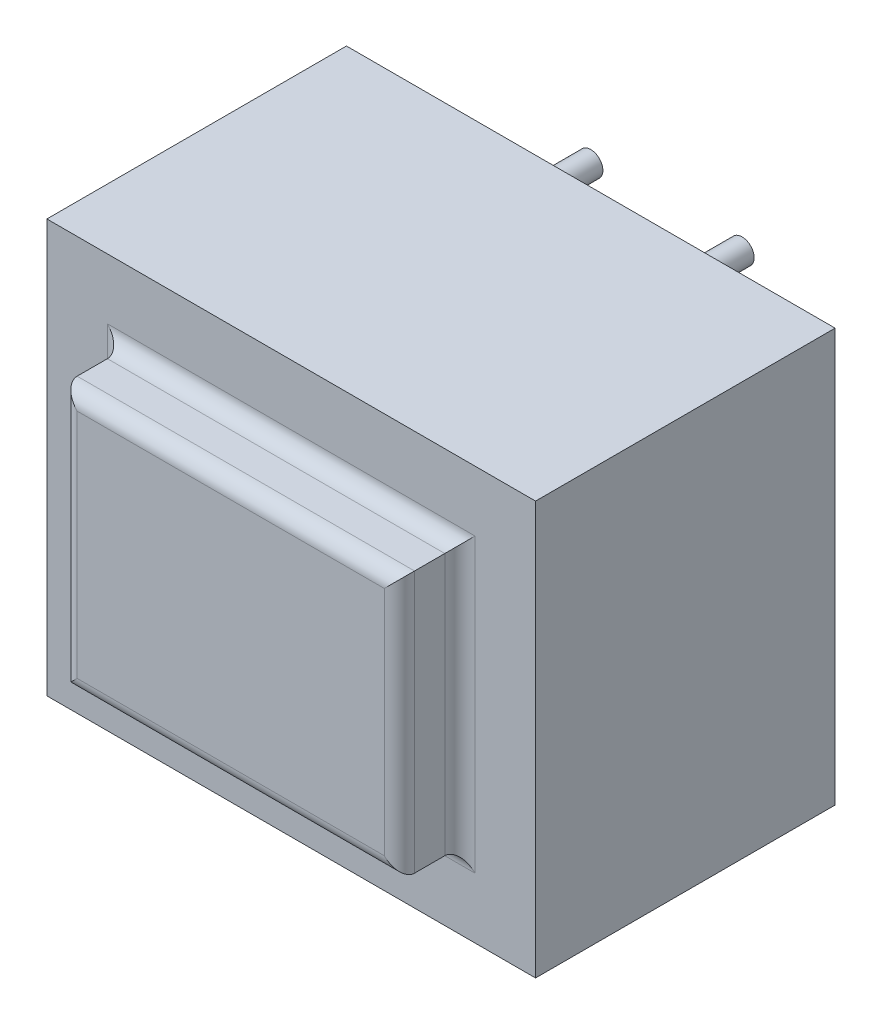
ISO-10303-21;
HEADER;
FILE_DESCRIPTION(('STEP AP214'),'2;1');
FILE_NAME('part.step','',(''),(''),'','','');
FILE_SCHEMA(('AUTOMOTIVE_DESIGN { 1 0 10303 214 1 1 1 1 }'));
ENDSEC;
DATA;
#1=APPLICATION_CONTEXT('core data for automotive mechanical design processes');
#2=APPLICATION_PROTOCOL_DEFINITION('international standard','automotive_design',2000,#1);
#3=PRODUCT_CONTEXT('',#1,'mechanical');
#4=PRODUCT('Part','Part','',(#3));
#5=PRODUCT_RELATED_PRODUCT_CATEGORY('part','',(#4));
#6=PRODUCT_DEFINITION_FORMATION('','',#4);
#7=PRODUCT_DEFINITION_CONTEXT('part definition',#1,'design');
#8=PRODUCT_DEFINITION('design','',#6,#7);
#9=PRODUCT_DEFINITION_SHAPE('','',#8);
#10=(LENGTH_UNIT() NAMED_UNIT(*) SI_UNIT(.MILLI.,.METRE.));
#11=(NAMED_UNIT(*) PLANE_ANGLE_UNIT() SI_UNIT($,.RADIAN.));
#12=(NAMED_UNIT(*) SI_UNIT($,.STERADIAN.) SOLID_ANGLE_UNIT());
#13=UNCERTAINTY_MEASURE_WITH_UNIT(LENGTH_MEASURE(1.E-05),#10,'distance_accuracy_value','');
#14=(GEOMETRIC_REPRESENTATION_CONTEXT(3) GLOBAL_UNCERTAINTY_ASSIGNED_CONTEXT((#13)) GLOBAL_UNIT_ASSIGNED_CONTEXT((#10,
#11,#12)) REPRESENTATION_CONTEXT('',''));
#15=CARTESIAN_POINT('',(0.,0.,0.));
#16=DIRECTION('',(0.,0.,1.));
#17=DIRECTION('',(1.,0.,0.));
#18=AXIS2_PLACEMENT_3D('',#15,#16,#17);
#19=CARTESIAN_POINT('',(0.,0.,0.));
#20=DIRECTION('',(0.,0.,-1.));
#21=DIRECTION('',(-1.,0.,0.));
#22=AXIS2_PLACEMENT_3D('',#19,#20,#21);
#23=PLANE('',#22);
#24=CARTESIAN_POINT('',(11.15,23.65,0.));
#25=DIRECTION('',(0.,0.,-1.));
#26=DIRECTION('',(-1.,0.,0.));
#27=AXIS2_PLACEMENT_3D('',#24,#25,#26);
#28=CIRCLE('',#27,0.8);
#29=CARTESIAN_POINT('',(10.35,23.65,0.));
#30=VERTEX_POINT('',#29);
#31=EDGE_CURVE('E524',#30,#30,#28,.T.);
#32=ORIENTED_EDGE('',*,*,#31,.F.);
#33=EDGE_LOOP('',(#32));
#34=FACE_BOUND('',#33,.T.);
#35=CARTESIAN_POINT('',(6.15,3.65,0.));
#36=DIRECTION('',(0.,0.,-1.));
#37=DIRECTION('',(-1.,0.,0.));
#38=AXIS2_PLACEMENT_3D('',#35,#36,#37);
#39=CIRCLE('',#38,0.800000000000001);
#40=CARTESIAN_POINT('',(5.35,3.65,0.));
#41=VERTEX_POINT('',#40);
#42=EDGE_CURVE('E535',#41,#41,#39,.T.);
#43=ORIENTED_EDGE('',*,*,#42,.F.);
#44=EDGE_LOOP('',(#43));
#45=FACE_BOUND('',#44,.T.);
#46=DIRECTION('',(0.,-1.,0.));
#47=VECTOR('',#46,1.);
#48=CARTESIAN_POINT('',(0.,0.,0.));
#49=LINE('',#48,#47);
#50=CARTESIAN_POINT('',(0.,27.3,0.));
#51=VERTEX_POINT('',#50);
#52=CARTESIAN_POINT('',(0.,0.,0.));
#53=VERTEX_POINT('',#52);
#54=EDGE_CURVE('E146',#51,#53,#49,.T.);
#55=ORIENTED_EDGE('',*,*,#54,.F.);
#56=DIRECTION('',(-1.,0.,0.));
#57=VECTOR('',#56,1.);
#58=CARTESIAN_POINT('',(0.,27.3,0.));
#59=LINE('',#58,#57);
#60=CARTESIAN_POINT('',(32.3,27.3,0.));
#61=VERTEX_POINT('',#60);
#62=EDGE_CURVE('E142',#61,#51,#59,.T.);
#63=ORIENTED_EDGE('',*,*,#62,.F.);
#64=DIRECTION('',(0.,1.,0.));
#65=VECTOR('',#64,1.);
#66=CARTESIAN_POINT('',(32.3,0.,0.));
#67=LINE('',#66,#65);
#68=CARTESIAN_POINT('',(32.3,0.,0.));
#69=VERTEX_POINT('',#68);
#70=EDGE_CURVE('E505',#69,#61,#67,.T.);
#71=ORIENTED_EDGE('',*,*,#70,.F.);
#72=DIRECTION('',(1.,0.,0.));
#73=VECTOR('',#72,1.);
#74=CARTESIAN_POINT('',(0.,0.,0.));
#75=LINE('',#74,#73);
#76=EDGE_CURVE('E503',#53,#69,#75,.T.);
#77=ORIENTED_EDGE('',*,*,#76,.F.);
#78=EDGE_LOOP('',(#55,#63,#71,#77));
#79=FACE_BOUND('',#78,.T.);
#80=CARTESIAN_POINT('',(26.15,3.64999999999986,0.));
#81=DIRECTION('',(0.,0.,-1.));
#82=DIRECTION('',(-1.,0.,0.));
#83=AXIS2_PLACEMENT_3D('',#80,#81,#82);
#84=CIRCLE('',#83,0.799999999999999);
#85=CARTESIAN_POINT('',(25.35,3.64999999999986,0.));
#86=VERTEX_POINT('',#85);
#87=EDGE_CURVE('E517',#86,#86,#84,.T.);
#88=ORIENTED_EDGE('',*,*,#87,.F.);
#89=EDGE_LOOP('',(#88));
#90=FACE_BOUND('',#89,.T.);
#91=CARTESIAN_POINT('',(21.15,23.6499999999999,0.));
#92=DIRECTION('',(0.,0.,-1.));
#93=DIRECTION('',(-1.,0.,0.));
#94=AXIS2_PLACEMENT_3D('',#91,#92,#93);
#95=CIRCLE('',#94,0.799999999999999);
#96=CARTESIAN_POINT('',(20.35,23.6499999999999,0.));
#97=VERTEX_POINT('',#96);
#98=EDGE_CURVE('E193',#97,#97,#95,.T.);
#99=ORIENTED_EDGE('',*,*,#98,.F.);
#100=EDGE_LOOP('',(#99));
#101=FACE_BOUND('',#100,.T.);
#102=ADVANCED_FACE('F33',(#34,#45,#79,#90,#101),#23,.T.);
#103=CARTESIAN_POINT('',(0.,0.,19.8));
#104=DIRECTION('',(0.,0.,-1.));
#105=DIRECTION('',(-1.,0.,0.));
#106=AXIS2_PLACEMENT_3D('',#103,#104,#105);
#107=PLANE('',#106);
#108=DIRECTION('',(-1.,0.,0.));
#109=VECTOR('',#108,1.);
#110=CARTESIAN_POINT('',(27.3,23.3,19.8));
#111=LINE('',#110,#109);
#112=CARTESIAN_POINT('',(4.,23.3,19.8));
#113=VERTEX_POINT('',#112);
#114=CARTESIAN_POINT('',(28.3,23.3,19.8));
#115=VERTEX_POINT('',#114);
#116=EDGE_CURVE('E42',#113,#115,#111,.F.);
#117=ORIENTED_EDGE('',*,*,#116,.T.);
#118=DIRECTION('',(0.,1.,0.));
#119=VECTOR('',#118,1.);
#120=CARTESIAN_POINT('',(28.3,5.,19.8));
#121=LINE('',#120,#119);
#122=CARTESIAN_POINT('',(28.3,4.,19.8));
#123=VERTEX_POINT('',#122);
#124=EDGE_CURVE('E11',#115,#123,#121,.F.);
#125=ORIENTED_EDGE('',*,*,#124,.T.);
#126=DIRECTION('',(1.,0.,0.));
#127=VECTOR('',#126,1.);
#128=CARTESIAN_POINT('',(5.,4.,19.8));
#129=LINE('',#128,#127);
#130=CARTESIAN_POINT('',(4.,4.,19.8));
#131=VERTEX_POINT('',#130);
#132=EDGE_CURVE('E179',#123,#131,#129,.F.);
#133=ORIENTED_EDGE('',*,*,#132,.T.);
#134=DIRECTION('',(0.,-1.,0.));
#135=VECTOR('',#134,1.);
#136=CARTESIAN_POINT('',(4.,22.3,19.8));
#137=LINE('',#136,#135);
#138=EDGE_CURVE('E53',#131,#113,#137,.F.);
#139=ORIENTED_EDGE('',*,*,#138,.T.);
#140=EDGE_LOOP('',(#117,#125,#133,#139));
#141=FACE_BOUND('',#140,.T.);
#142=DIRECTION('',(0.,-1.,0.));
#143=VECTOR('',#142,1.);
#144=CARTESIAN_POINT('',(0.,0.,19.8));
#145=LINE('',#144,#143);
#146=CARTESIAN_POINT('',(0.,27.3,19.8));
#147=VERTEX_POINT('',#146);
#148=CARTESIAN_POINT('',(0.,0.,19.8));
#149=VERTEX_POINT('',#148);
#150=EDGE_CURVE('E133',#147,#149,#145,.T.);
#151=ORIENTED_EDGE('',*,*,#150,.T.);
#152=DIRECTION('',(1.,0.,0.));
#153=VECTOR('',#152,1.);
#154=CARTESIAN_POINT('',(0.,0.,19.8));
#155=LINE('',#154,#153);
#156=CARTESIAN_POINT('',(32.3,0.,19.8));
#157=VERTEX_POINT('',#156);
#158=EDGE_CURVE('E122',#149,#157,#155,.T.);
#159=ORIENTED_EDGE('',*,*,#158,.T.);
#160=DIRECTION('',(0.,1.,0.));
#161=VECTOR('',#160,1.);
#162=CARTESIAN_POINT('',(32.3,0.,19.8));
#163=LINE('',#162,#161);
#164=CARTESIAN_POINT('',(32.3,27.3,19.8));
#165=VERTEX_POINT('',#164);
#166=EDGE_CURVE('E132',#157,#165,#163,.T.);
#167=ORIENTED_EDGE('',*,*,#166,.T.);
#168=DIRECTION('',(-1.,0.,0.));
#169=VECTOR('',#168,1.);
#170=CARTESIAN_POINT('',(0.,27.3,19.8));
#171=LINE('',#170,#169);
#172=EDGE_CURVE('E138',#165,#147,#171,.T.);
#173=ORIENTED_EDGE('',*,*,#172,.T.);
#174=EDGE_LOOP('',(#151,#159,#167,#173));
#175=FACE_BOUND('',#174,.T.);
#176=ADVANCED_FACE('F136',(#141,#175),#107,.F.);
#177=CARTESIAN_POINT('',(0.,0.,19.8));
#178=DIRECTION('',(1.,0.,0.));
#179=DIRECTION('',(0.,0.,-1.));
#180=AXIS2_PLACEMENT_3D('',#177,#178,#179);
#181=PLANE('',#180);
#182=ORIENTED_EDGE('',*,*,#54,.T.);
#183=DIRECTION('',(0.,0.,-1.));
#184=VECTOR('',#183,1.);
#185=CARTESIAN_POINT('',(0.,0.,19.8));
#186=LINE('',#185,#184);
#187=EDGE_CURVE('E126',#149,#53,#186,.T.);
#188=ORIENTED_EDGE('',*,*,#187,.F.);
#189=ORIENTED_EDGE('',*,*,#150,.F.);
#190=DIRECTION('',(0.,0.,-1.));
#191=VECTOR('',#190,1.);
#192=CARTESIAN_POINT('',(0.,27.3,19.8));
#193=LINE('',#192,#191);
#194=EDGE_CURVE('E501',#147,#51,#193,.T.);
#195=ORIENTED_EDGE('',*,*,#194,.T.);
#196=EDGE_LOOP('',(#182,#188,#189,#195));
#197=FACE_BOUND('',#196,.T.);
#198=ADVANCED_FACE('F144',(#197),#181,.F.);
#199=CARTESIAN_POINT('',(0.,0.,19.8));
#200=DIRECTION('',(0.,1.,0.));
#201=DIRECTION('',(0.,0.,1.));
#202=AXIS2_PLACEMENT_3D('',#199,#200,#201);
#203=PLANE('',#202);
#204=ORIENTED_EDGE('',*,*,#76,.T.);
#205=DIRECTION('',(0.,0.,-1.));
#206=VECTOR('',#205,1.);
#207=CARTESIAN_POINT('',(32.3,0.,19.8));
#208=LINE('',#207,#206);
#209=EDGE_CURVE('E129',#157,#69,#208,.T.);
#210=ORIENTED_EDGE('',*,*,#209,.F.);
#211=ORIENTED_EDGE('',*,*,#158,.F.);
#212=ORIENTED_EDGE('',*,*,#187,.T.);
#213=EDGE_LOOP('',(#204,#210,#211,#212));
#214=FACE_BOUND('',#213,.T.);
#215=ADVANCED_FACE('F124',(#214),#203,.F.);
#216=CARTESIAN_POINT('',(32.3,0.,19.8));
#217=DIRECTION('',(-1.,0.,0.));
#218=DIRECTION('',(0.,0.,1.));
#219=AXIS2_PLACEMENT_3D('',#216,#217,#218);
#220=PLANE('',#219);
#221=ORIENTED_EDGE('',*,*,#70,.T.);
#222=DIRECTION('',(0.,0.,-1.));
#223=VECTOR('',#222,1.);
#224=CARTESIAN_POINT('',(32.3,27.3,19.8));
#225=LINE('',#224,#223);
#226=EDGE_CURVE('E151',#165,#61,#225,.T.);
#227=ORIENTED_EDGE('',*,*,#226,.F.);
#228=ORIENTED_EDGE('',*,*,#166,.F.);
#229=ORIENTED_EDGE('',*,*,#209,.T.);
#230=EDGE_LOOP('',(#221,#227,#228,#229));
#231=FACE_BOUND('',#230,.T.);
#232=ADVANCED_FACE('F231',(#231),#220,.F.);
#233=CARTESIAN_POINT('',(0.,27.3,19.8));
#234=DIRECTION('',(0.,-1.,0.));
#235=DIRECTION('',(0.,0.,-1.));
#236=AXIS2_PLACEMENT_3D('',#233,#234,#235);
#237=PLANE('',#236);
#238=ORIENTED_EDGE('',*,*,#62,.T.);
#239=ORIENTED_EDGE('',*,*,#194,.F.);
#240=ORIENTED_EDGE('',*,*,#172,.F.);
#241=ORIENTED_EDGE('',*,*,#226,.T.);
#242=EDGE_LOOP('',(#238,#239,#240,#241));
#243=FACE_BOUND('',#242,.T.);
#244=ADVANCED_FACE('F228',(#243),#237,.F.);
#245=CARTESIAN_POINT('',(5.,22.3,23.8));
#246=DIRECTION('',(1.,0.,0.));
#247=DIRECTION('',(0.,1.,0.));
#248=AXIS2_PLACEMENT_3D('',#245,#246,#247);
#249=PLANE('',#248);
#250=DIRECTION('',(0.,0.,-1.));
#251=VECTOR('',#250,1.);
#252=CARTESIAN_POINT('',(5.,5.,23.8));
#253=LINE('',#252,#251);
#254=CARTESIAN_POINT('',(5.,5.,22.8));
#255=VERTEX_POINT('',#254);
#256=CARTESIAN_POINT('',(5.,5.,20.8));
#257=VERTEX_POINT('',#256);
#258=EDGE_CURVE('E470',#255,#257,#253,.T.);
#259=ORIENTED_EDGE('',*,*,#258,.F.);
#260=DIRECTION('',(0.,-1.,0.));
#261=VECTOR('',#260,1.);
#262=CARTESIAN_POINT('',(5.,22.3,22.8));
#263=LINE('',#262,#261);
#264=CARTESIAN_POINT('',(5.,22.3,22.8));
#265=VERTEX_POINT('',#264);
#266=EDGE_CURVE('E163',#255,#265,#263,.F.);
#267=ORIENTED_EDGE('',*,*,#266,.T.);
#268=DIRECTION('',(0.,0.,-1.));
#269=VECTOR('',#268,1.);
#270=CARTESIAN_POINT('',(5.,22.3,23.8));
#271=LINE('',#270,#269);
#272=CARTESIAN_POINT('',(5.,22.3,20.8));
#273=VERTEX_POINT('',#272);
#274=EDGE_CURVE('E489',#265,#273,#271,.T.);
#275=ORIENTED_EDGE('',*,*,#274,.T.);
#276=DIRECTION('',(0.,-1.,0.));
#277=VECTOR('',#276,1.);
#278=CARTESIAN_POINT('',(5.,5.,20.8));
#279=LINE('',#278,#277);
#280=EDGE_CURVE('E161',#273,#257,#279,.T.);
#281=ORIENTED_EDGE('',*,*,#280,.T.);
#282=EDGE_LOOP('',(#259,#267,#275,#281));
#283=FACE_BOUND('',#282,.T.);
#284=ADVANCED_FACE('F225',(#283),#249,.F.);
#285=CARTESIAN_POINT('',(5.,5.,23.8));
#286=DIRECTION('',(0.,1.,0.));
#287=DIRECTION('',(-1.,0.,0.));
#288=AXIS2_PLACEMENT_3D('',#285,#286,#287);
#289=PLANE('',#288);
#290=DIRECTION('',(0.,0.,-1.));
#291=VECTOR('',#290,1.);
#292=CARTESIAN_POINT('',(27.3,5.,23.8));
#293=LINE('',#292,#291);
#294=CARTESIAN_POINT('',(27.3,5.,22.8));
#295=VERTEX_POINT('',#294);
#296=CARTESIAN_POINT('',(27.3,5.,20.8));
#297=VERTEX_POINT('',#296);
#298=EDGE_CURVE('E474',#295,#297,#293,.T.);
#299=ORIENTED_EDGE('',*,*,#298,.F.);
#300=DIRECTION('',(1.,0.,0.));
#301=VECTOR('',#300,1.);
#302=CARTESIAN_POINT('',(5.,5.,22.8));
#303=LINE('',#302,#301);
#304=EDGE_CURVE('E168',#295,#255,#303,.F.);
#305=ORIENTED_EDGE('',*,*,#304,.T.);
#306=ORIENTED_EDGE('',*,*,#258,.T.);
#307=DIRECTION('',(1.,0.,0.));
#308=VECTOR('',#307,1.);
#309=CARTESIAN_POINT('',(27.3,5.,20.8));
#310=LINE('',#309,#308);
#311=EDGE_CURVE('E166',#257,#297,#310,.T.);
#312=ORIENTED_EDGE('',*,*,#311,.T.);
#313=EDGE_LOOP('',(#299,#305,#306,#312));
#314=FACE_BOUND('',#313,.T.);
#315=ADVANCED_FACE('F367',(#314),#289,.F.);
#316=CARTESIAN_POINT('',(27.3,22.3,23.8));
#317=DIRECTION('',(-1.,0.,0.));
#318=DIRECTION('',(0.,0.,1.));
#319=AXIS2_PLACEMENT_3D('',#316,#317,#318);
#320=PLANE('',#319);
#321=DIRECTION('',(0.,0.,-1.));
#322=VECTOR('',#321,1.);
#323=CARTESIAN_POINT('',(27.3,22.3,23.8));
#324=LINE('',#323,#322);
#325=CARTESIAN_POINT('',(27.3,22.3,22.8));
#326=VERTEX_POINT('',#325);
#327=CARTESIAN_POINT('',(27.3,22.3,20.8));
#328=VERTEX_POINT('',#327);
#329=EDGE_CURVE('E488',#326,#328,#324,.T.);
#330=ORIENTED_EDGE('',*,*,#329,.F.);
#331=DIRECTION('',(0.,1.,0.));
#332=VECTOR('',#331,1.);
#333=CARTESIAN_POINT('',(27.3,5.,22.8));
#334=LINE('',#333,#332);
#335=EDGE_CURVE('E177',#326,#295,#334,.F.);
#336=ORIENTED_EDGE('',*,*,#335,.T.);
#337=ORIENTED_EDGE('',*,*,#298,.T.);
#338=DIRECTION('',(0.,1.,0.));
#339=VECTOR('',#338,1.);
#340=CARTESIAN_POINT('',(27.3,22.3,20.8));
#341=LINE('',#340,#339);
#342=EDGE_CURVE('E174',#297,#328,#341,.T.);
#343=ORIENTED_EDGE('',*,*,#342,.T.);
#344=EDGE_LOOP('',(#330,#336,#337,#343));
#345=FACE_BOUND('',#344,.T.);
#346=ADVANCED_FACE('F359',(#345),#320,.F.);
#347=CARTESIAN_POINT('',(5.,22.3,23.8));
#348=DIRECTION('',(0.,-1.,0.));
#349=DIRECTION('',(0.,0.,-1.));
#350=AXIS2_PLACEMENT_3D('',#347,#348,#349);
#351=PLANE('',#350);
#352=ORIENTED_EDGE('',*,*,#274,.F.);
#353=DIRECTION('',(-1.,0.,0.));
#354=VECTOR('',#353,1.);
#355=CARTESIAN_POINT('',(27.3,22.3,22.8));
#356=LINE('',#355,#354);
#357=EDGE_CURVE('E172',#265,#326,#356,.F.);
#358=ORIENTED_EDGE('',*,*,#357,.T.);
#359=ORIENTED_EDGE('',*,*,#329,.T.);
#360=DIRECTION('',(-1.,0.,0.));
#361=VECTOR('',#360,1.);
#362=CARTESIAN_POINT('',(5.,22.3,20.8));
#363=LINE('',#362,#361);
#364=EDGE_CURVE('E170',#328,#273,#363,.T.);
#365=ORIENTED_EDGE('',*,*,#364,.T.);
#366=EDGE_LOOP('',(#352,#358,#359,#365));
#367=FACE_BOUND('',#366,.T.);
#368=ADVANCED_FACE('F351',(#367),#351,.F.);
#369=CARTESIAN_POINT('',(0.,0.,23.8));
#370=DIRECTION('',(0.,0.,1.));
#371=DIRECTION('',(1.,0.,0.));
#372=AXIS2_PLACEMENT_3D('',#369,#370,#371);
#373=PLANE('',#372);
#374=DIRECTION('',(-1.,0.,0.));
#375=VECTOR('',#374,1.);
#376=CARTESIAN_POINT('',(5.,21.3,23.8));
#377=LINE('',#376,#375);
#378=CARTESIAN_POINT('',(26.3,21.3,23.8));
#379=VERTEX_POINT('',#378);
#380=CARTESIAN_POINT('',(6.,21.3,23.8));
#381=VERTEX_POINT('',#380);
#382=EDGE_CURVE('E149',#379,#381,#377,.T.);
#383=ORIENTED_EDGE('',*,*,#382,.T.);
#384=DIRECTION('',(0.,-1.,0.));
#385=VECTOR('',#384,1.);
#386=CARTESIAN_POINT('',(6.,5.,23.8));
#387=LINE('',#386,#385);
#388=CARTESIAN_POINT('',(6.,6.,23.8));
#389=VERTEX_POINT('',#388);
#390=EDGE_CURVE('E158',#381,#389,#387,.T.);
#391=ORIENTED_EDGE('',*,*,#390,.T.);
#392=DIRECTION('',(1.,0.,0.));
#393=VECTOR('',#392,1.);
#394=CARTESIAN_POINT('',(27.3,6.,23.8));
#395=LINE('',#394,#393);
#396=CARTESIAN_POINT('',(26.3,6.,23.8));
#397=VERTEX_POINT('',#396);
#398=EDGE_CURVE('E156',#389,#397,#395,.T.);
#399=ORIENTED_EDGE('',*,*,#398,.T.);
#400=DIRECTION('',(0.,1.,0.));
#401=VECTOR('',#400,1.);
#402=CARTESIAN_POINT('',(26.3,22.3,23.8));
#403=LINE('',#402,#401);
#404=EDGE_CURVE('E147',#397,#379,#403,.T.);
#405=ORIENTED_EDGE('',*,*,#404,.T.);
#406=EDGE_LOOP('',(#383,#391,#399,#405));
#407=FACE_BOUND('',#406,.T.);
#408=ADVANCED_FACE('F343',(#407),#373,.T.);
#409=CARTESIAN_POINT('',(6.15,3.65,-5.));
#410=DIRECTION('',(0.,0.,1.));
#411=DIRECTION('',(1.,0.,0.));
#412=AXIS2_PLACEMENT_3D('',#409,#410,#411);
#413=CYLINDRICAL_SURFACE('',#412,0.800000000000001);
#414=CARTESIAN_POINT('',(6.15,3.65,-5.));
#415=DIRECTION('',(0.,0.,-1.));
#416=DIRECTION('',(-1.,0.,0.));
#417=AXIS2_PLACEMENT_3D('',#414,#415,#416);
#418=CIRCLE('',#417,0.800000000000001);
#419=CARTESIAN_POINT('',(5.35,3.65,-5.));
#420=VERTEX_POINT('',#419);
#421=EDGE_CURVE('E495',#420,#420,#418,.T.);
#422=ORIENTED_EDGE('',*,*,#421,.F.);
#423=EDGE_LOOP('',(#422));
#424=FACE_BOUND('',#423,.T.);
#425=ORIENTED_EDGE('',*,*,#42,.T.);
#426=EDGE_LOOP('',(#425));
#427=FACE_BOUND('',#426,.T.);
#428=ADVANCED_FACE('F335',(#424,#427),#413,.T.);
#429=CARTESIAN_POINT('',(6.15,3.65,-5.));
#430=DIRECTION('',(0.,0.,-1.));
#431=DIRECTION('',(-1.,0.,0.));
#432=AXIS2_PLACEMENT_3D('',#429,#430,#431);
#433=PLANE('',#432);
#434=ORIENTED_EDGE('',*,*,#421,.T.);
#435=EDGE_LOOP('',(#434));
#436=FACE_BOUND('',#435,.T.);
#437=ADVANCED_FACE('F327',(#436),#433,.T.);
#438=CARTESIAN_POINT('',(26.15,3.64999999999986,-5.));
#439=DIRECTION('',(0.,0.,1.));
#440=DIRECTION('',(1.,0.,0.));
#441=AXIS2_PLACEMENT_3D('',#438,#439,#440);
#442=CYLINDRICAL_SURFACE('',#441,0.799999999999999);
#443=CARTESIAN_POINT('',(26.15,3.64999999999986,-5.));
#444=DIRECTION('',(0.,0.,-1.));
#445=DIRECTION('',(-1.,0.,0.));
#446=AXIS2_PLACEMENT_3D('',#443,#444,#445);
#447=CIRCLE('',#446,0.799999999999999);
#448=CARTESIAN_POINT('',(25.35,3.64999999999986,-5.));
#449=VERTEX_POINT('',#448);
#450=EDGE_CURVE('E532',#449,#449,#447,.T.);
#451=ORIENTED_EDGE('',*,*,#450,.F.);
#452=EDGE_LOOP('',(#451));
#453=FACE_BOUND('',#452,.T.);
#454=ORIENTED_EDGE('',*,*,#87,.T.);
#455=EDGE_LOOP('',(#454));
#456=FACE_BOUND('',#455,.T.);
#457=ADVANCED_FACE('F319',(#453,#456),#442,.T.);
#458=CARTESIAN_POINT('',(26.15,3.64999999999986,-5.));
#459=DIRECTION('',(0.,0.,-1.));
#460=DIRECTION('',(-1.,0.,0.));
#461=AXIS2_PLACEMENT_3D('',#458,#459,#460);
#462=PLANE('',#461);
#463=ORIENTED_EDGE('',*,*,#450,.T.);
#464=EDGE_LOOP('',(#463));
#465=FACE_BOUND('',#464,.T.);
#466=ADVANCED_FACE('F311',(#465),#462,.T.);
#467=CARTESIAN_POINT('',(11.15,23.65,-5.));
#468=DIRECTION('',(0.,0.,1.));
#469=DIRECTION('',(1.,0.,0.));
#470=AXIS2_PLACEMENT_3D('',#467,#468,#469);
#471=CYLINDRICAL_SURFACE('',#470,0.8);
#472=CARTESIAN_POINT('',(11.15,23.65,-5.));
#473=DIRECTION('',(0.,0.,-1.));
#474=DIRECTION('',(-1.,0.,0.));
#475=AXIS2_PLACEMENT_3D('',#472,#473,#474);
#476=CIRCLE('',#475,0.8);
#477=CARTESIAN_POINT('',(10.35,23.65,-5.));
#478=VERTEX_POINT('',#477);
#479=EDGE_CURVE('E527',#478,#478,#476,.T.);
#480=ORIENTED_EDGE('',*,*,#479,.F.);
#481=EDGE_LOOP('',(#480));
#482=FACE_BOUND('',#481,.T.);
#483=ORIENTED_EDGE('',*,*,#31,.T.);
#484=EDGE_LOOP('',(#483));
#485=FACE_BOUND('',#484,.T.);
#486=ADVANCED_FACE('F303',(#482,#485),#471,.T.);
#487=CARTESIAN_POINT('',(11.15,23.65,-5.));
#488=DIRECTION('',(0.,0.,-1.));
#489=DIRECTION('',(-1.,0.,0.));
#490=AXIS2_PLACEMENT_3D('',#487,#488,#489);
#491=PLANE('',#490);
#492=ORIENTED_EDGE('',*,*,#479,.T.);
#493=EDGE_LOOP('',(#492));
#494=FACE_BOUND('',#493,.T.);
#495=ADVANCED_FACE('F295',(#494),#491,.T.);
#496=CARTESIAN_POINT('',(21.15,23.6499999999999,-5.));
#497=DIRECTION('',(0.,0.,1.));
#498=DIRECTION('',(1.,0.,0.));
#499=AXIS2_PLACEMENT_3D('',#496,#497,#498);
#500=CYLINDRICAL_SURFACE('',#499,0.799999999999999);
#501=CARTESIAN_POINT('',(21.15,23.6499999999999,-5.));
#502=DIRECTION('',(0.,0.,-1.));
#503=DIRECTION('',(-1.,0.,0.));
#504=AXIS2_PLACEMENT_3D('',#501,#502,#503);
#505=CIRCLE('',#504,0.799999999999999);
#506=CARTESIAN_POINT('',(20.35,23.6499999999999,-5.));
#507=VERTEX_POINT('',#506);
#508=EDGE_CURVE('E521',#507,#507,#505,.T.);
#509=ORIENTED_EDGE('',*,*,#508,.F.);
#510=EDGE_LOOP('',(#509));
#511=FACE_BOUND('',#510,.T.);
#512=ORIENTED_EDGE('',*,*,#98,.T.);
#513=EDGE_LOOP('',(#512));
#514=FACE_BOUND('',#513,.T.);
#515=ADVANCED_FACE('F287',(#511,#514),#500,.T.);
#516=CARTESIAN_POINT('',(21.15,23.6499999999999,-5.));
#517=DIRECTION('',(0.,0.,-1.));
#518=DIRECTION('',(-1.,0.,0.));
#519=AXIS2_PLACEMENT_3D('',#516,#517,#518);
#520=PLANE('',#519);
#521=ORIENTED_EDGE('',*,*,#508,.T.);
#522=EDGE_LOOP('',(#521));
#523=FACE_BOUND('',#522,.T.);
#524=ADVANCED_FACE('F253',(#523),#520,.T.);
#525=CARTESIAN_POINT('',(26.3,0.,22.8));
#526=DIRECTION('',(0.,-1.,0.));
#527=DIRECTION('',(0.,0.,-1.));
#528=AXIS2_PLACEMENT_3D('',#525,#526,#527);
#529=CYLINDRICAL_SURFACE('',#528,1.);
#530=CARTESIAN_POINT('',(26.3,6.,22.8));
#531=DIRECTION('',(-0.707106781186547,-0.707106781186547,0.));
#532=DIRECTION('',(0.707106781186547,-0.707106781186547,0.));
#533=AXIS2_PLACEMENT_3D('',#530,#531,#532);
#534=ELLIPSE('',#533,1.41421356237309,1.);
#535=EDGE_CURVE('E187',#295,#397,#534,.T.);
#536=ORIENTED_EDGE('',*,*,#535,.F.);
#537=ORIENTED_EDGE('',*,*,#335,.F.);
#538=CARTESIAN_POINT('',(26.3,21.3,22.8));
#539=DIRECTION('',(0.707106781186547,-0.707106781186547,0.));
#540=DIRECTION('',(-0.707106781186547,-0.707106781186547,0.));
#541=AXIS2_PLACEMENT_3D('',#538,#539,#540);
#542=ELLIPSE('',#541,1.41421356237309,1.);
#543=EDGE_CURVE('E190',#379,#326,#542,.F.);
#544=ORIENTED_EDGE('',*,*,#543,.F.);
#545=ORIENTED_EDGE('',*,*,#404,.F.);
#546=EDGE_LOOP('',(#536,#537,#544,#545));
#547=FACE_BOUND('',#546,.T.);
#548=ADVANCED_FACE('F249',(#547),#529,.T.);
#549=CARTESIAN_POINT('',(0.,21.3,22.8));
#550=DIRECTION('',(1.,0.,0.));
#551=DIRECTION('',(0.,0.,-1.));
#552=AXIS2_PLACEMENT_3D('',#549,#550,#551);
#553=CYLINDRICAL_SURFACE('',#552,1.);
#554=ORIENTED_EDGE('',*,*,#543,.T.);
#555=ORIENTED_EDGE('',*,*,#357,.F.);
#556=CARTESIAN_POINT('',(6.,21.3,22.8));
#557=DIRECTION('',(0.707106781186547,0.707106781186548,0.));
#558=DIRECTION('',(0.707106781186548,-0.707106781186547,0.));
#559=AXIS2_PLACEMENT_3D('',#556,#557,#558);
#560=ELLIPSE('',#559,1.4142135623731,1.);
#561=EDGE_CURVE('E185',#381,#265,#560,.F.);
#562=ORIENTED_EDGE('',*,*,#561,.F.);
#563=ORIENTED_EDGE('',*,*,#382,.F.);
#564=EDGE_LOOP('',(#554,#555,#562,#563));
#565=FACE_BOUND('',#564,.T.);
#566=ADVANCED_FACE('F245',(#565),#553,.T.);
#567=CARTESIAN_POINT('',(0.,6.,22.8));
#568=DIRECTION('',(-1.,0.,0.));
#569=DIRECTION('',(0.,-1.,0.));
#570=AXIS2_PLACEMENT_3D('',#567,#568,#569);
#571=CYLINDRICAL_SURFACE('',#570,1.);
#572=ORIENTED_EDGE('',*,*,#535,.T.);
#573=ORIENTED_EDGE('',*,*,#398,.F.);
#574=CARTESIAN_POINT('',(6.,6.,22.8));
#575=DIRECTION('',(-0.707106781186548,0.707106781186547,0.));
#576=DIRECTION('',(-0.707106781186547,-0.707106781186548,0.));
#577=AXIS2_PLACEMENT_3D('',#574,#575,#576);
#578=ELLIPSE('',#577,1.41421356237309,1.);
#579=EDGE_CURVE('E183',#255,#389,#578,.T.);
#580=ORIENTED_EDGE('',*,*,#579,.F.);
#581=ORIENTED_EDGE('',*,*,#304,.F.);
#582=EDGE_LOOP('',(#572,#573,#580,#581));
#583=FACE_BOUND('',#582,.T.);
#584=ADVANCED_FACE('F241',(#583),#571,.T.);
#585=CARTESIAN_POINT('',(6.,0.,22.8));
#586=DIRECTION('',(0.,1.,0.));
#587=DIRECTION('',(-1.,0.,0.));
#588=AXIS2_PLACEMENT_3D('',#585,#586,#587);
#589=CYLINDRICAL_SURFACE('',#588,1.);
#590=ORIENTED_EDGE('',*,*,#561,.T.);
#591=ORIENTED_EDGE('',*,*,#266,.F.);
#592=ORIENTED_EDGE('',*,*,#579,.T.);
#593=ORIENTED_EDGE('',*,*,#390,.F.);
#594=EDGE_LOOP('',(#590,#591,#592,#593));
#595=FACE_BOUND('',#594,.T.);
#596=ADVANCED_FACE('F238',(#595),#589,.T.);
#597=CARTESIAN_POINT('',(4.,22.3,20.8));
#598=DIRECTION('',(0.,1.,0.));
#599=DIRECTION('',(-1.,0.,0.));
#600=AXIS2_PLACEMENT_3D('',#597,#598,#599);
#601=CYLINDRICAL_SURFACE('',#600,1.);
#602=CARTESIAN_POINT('',(4.,23.3,20.8));
#603=DIRECTION('',(0.707106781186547,0.707106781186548,0.));
#604=DIRECTION('',(-0.707106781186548,0.707106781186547,0.));
#605=AXIS2_PLACEMENT_3D('',#602,#603,#604);
#606=ELLIPSE('',#605,1.4142135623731,1.);
#607=EDGE_CURVE('E197',#113,#273,#606,.F.);
#608=ORIENTED_EDGE('',*,*,#607,.F.);
#609=ORIENTED_EDGE('',*,*,#138,.F.);
#610=CARTESIAN_POINT('',(4.,4.,20.8));
#611=DIRECTION('',(-0.707106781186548,0.707106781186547,0.));
#612=DIRECTION('',(-0.707106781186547,-0.707106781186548,0.));
#613=AXIS2_PLACEMENT_3D('',#610,#611,#612);
#614=ELLIPSE('',#613,1.41421356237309,1.);
#615=EDGE_CURVE('E37',#257,#131,#614,.T.);
#616=ORIENTED_EDGE('',*,*,#615,.F.);
#617=ORIENTED_EDGE('',*,*,#280,.F.);
#618=EDGE_LOOP('',(#608,#609,#616,#617));
#619=FACE_BOUND('',#618,.T.);
#620=ADVANCED_FACE('F35',(#619),#601,.F.);
#621=CARTESIAN_POINT('',(5.,4.,20.8));
#622=DIRECTION('',(-1.,0.,0.));
#623=DIRECTION('',(0.,-1.,0.));
#624=AXIS2_PLACEMENT_3D('',#621,#622,#623);
#625=CYLINDRICAL_SURFACE('',#624,1.);
#626=ORIENTED_EDGE('',*,*,#615,.T.);
#627=ORIENTED_EDGE('',*,*,#132,.F.);
#628=CARTESIAN_POINT('',(28.3,4.,20.8));
#629=DIRECTION('',(-0.707106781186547,-0.707106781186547,0.));
#630=DIRECTION('',(-0.707106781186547,0.707106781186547,0.));
#631=AXIS2_PLACEMENT_3D('',#628,#629,#630);
#632=ELLIPSE('',#631,1.41421356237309,1.);
#633=EDGE_CURVE('E196',#297,#123,#632,.T.);
#634=ORIENTED_EDGE('',*,*,#633,.F.);
#635=ORIENTED_EDGE('',*,*,#311,.F.);
#636=EDGE_LOOP('',(#626,#627,#634,#635));
#637=FACE_BOUND('',#636,.T.);
#638=ADVANCED_FACE('F206',(#637),#625,.F.);
#639=CARTESIAN_POINT('',(5.,23.3,20.8));
#640=DIRECTION('',(1.,0.,0.));
#641=DIRECTION('',(0.,0.,-1.));
#642=AXIS2_PLACEMENT_3D('',#639,#640,#641);
#643=CYLINDRICAL_SURFACE('',#642,1.);
#644=ORIENTED_EDGE('',*,*,#607,.T.);
#645=ORIENTED_EDGE('',*,*,#364,.F.);
#646=CARTESIAN_POINT('',(28.3,23.3,20.8));
#647=DIRECTION('',(0.707106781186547,-0.707106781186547,0.));
#648=DIRECTION('',(0.707106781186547,0.707106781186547,0.));
#649=AXIS2_PLACEMENT_3D('',#646,#647,#648);
#650=ELLIPSE('',#649,1.41421356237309,1.);
#651=EDGE_CURVE('E194',#115,#328,#650,.F.);
#652=ORIENTED_EDGE('',*,*,#651,.F.);
#653=ORIENTED_EDGE('',*,*,#116,.F.);
#654=EDGE_LOOP('',(#644,#645,#652,#653));
#655=FACE_BOUND('',#654,.T.);
#656=ADVANCED_FACE('F211',(#655),#643,.F.);
#657=CARTESIAN_POINT('',(28.3,22.3,20.8));
#658=DIRECTION('',(0.,-1.,0.));
#659=DIRECTION('',(0.,0.,-1.));
#660=AXIS2_PLACEMENT_3D('',#657,#658,#659);
#661=CYLINDRICAL_SURFACE('',#660,1.);
#662=ORIENTED_EDGE('',*,*,#633,.T.);
#663=ORIENTED_EDGE('',*,*,#124,.F.);
#664=ORIENTED_EDGE('',*,*,#651,.T.);
#665=ORIENTED_EDGE('',*,*,#342,.F.);
#666=EDGE_LOOP('',(#662,#663,#664,#665));
#667=FACE_BOUND('',#666,.T.);
#668=ADVANCED_FACE('F214',(#667),#661,.F.);
#669=CLOSED_SHELL('',(#102,#176,#198,#215,#232,#244,#284,#315,#346,#368,#408,#428,#437,#457,
#466,#486,#495,#515,#524,#548,#566,#584,#596,#620,#638,#656,#668));
#670=MANIFOLD_SOLID_BREP('B2',#669);
#671=ADVANCED_BREP_SHAPE_REPRESENTATION('',(#18,#670),#14);
#672=SHAPE_DEFINITION_REPRESENTATION(#9,#671);
ENDSEC;
END-ISO-10303-21;
